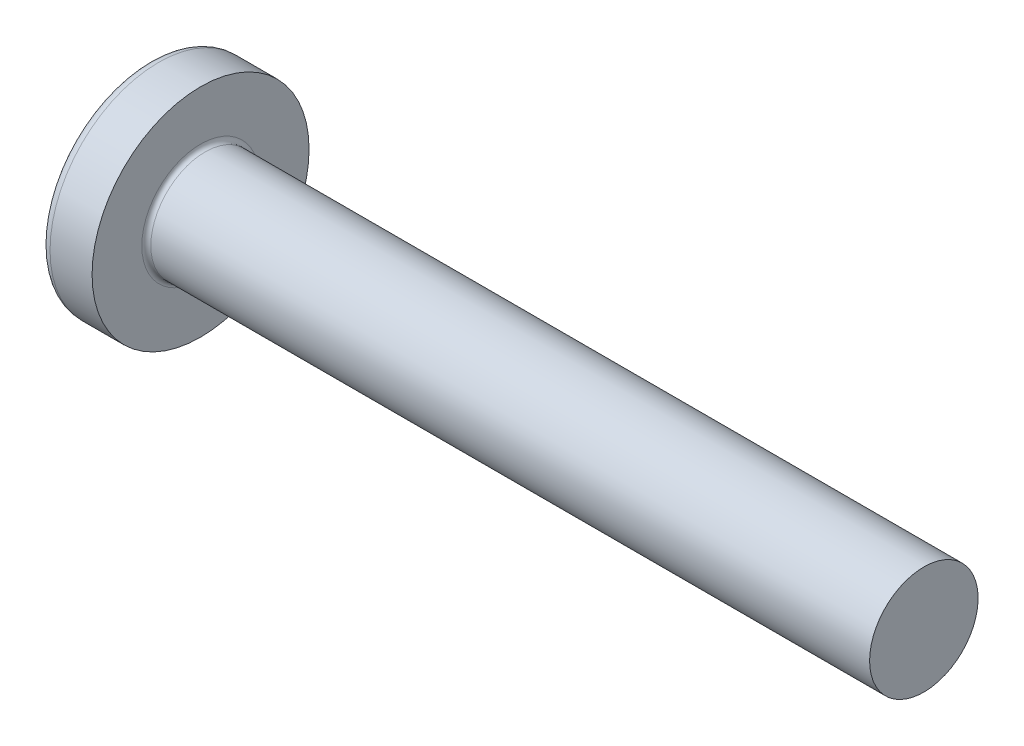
from build123d import *

# Parameters (mm, degrees)
FILLET1_R    = 0.25
RECPAT_COUNT = 2
RECPAT_ANGLE = 90


with BuildPart() as part:
    # BodySke → Base-Revolve (revolve)
    with BuildSketch(Plane.XY, mode=Mode.PRIVATE) as base_revolve_sk:
        with BuildLine():
            Line((4.6, 3), (4.6, 6))
            Line((4.6, 6), (2.274716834, 6))
            ThreePointArc((2.274716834, 6), (2.026424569, 5.939532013), (1.833738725, 5.77167019))
            ThreePointArc((1.833738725, 5.77167019), (0.469454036, 3.027985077), (0, 0))
            Line((0, 0), (44.6, 0))
            Line((44.6, 0), (44.6, 3))
            Line((44.6, 3), (4.6, 3))
        make_face()
    revolve(base_revolve_sk.sketch.rotate(Axis((2.274716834, 0, 0), (1, 0, 0)), 90), axis=Axis((2.274716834, 0, 0), (1, 0, 0)))

    # Fillet1
    fillet1_edges = [part.edges().sort_by_distance(p)[0] for p in [
        (4.6, 0, -3),
    ]]
    fillet(fillet1_edges, radius=FILLET1_R)

    # Sketch3 → Recess section 0
    with BuildSketch(Plane(origin=(0, 0, 0), x_dir=(0, 0, -1), z_dir=(1, 0, 0))):
        with BuildLine():
            Line((0.71, -3.35), (-0.71, -3.35))
            Line((-0.71, -3.35), (-0.71, 3.35))
            Line((-0.71, 3.35), (0.71, 3.35))
            Line((0.71, 3.35), (0.71, -3.35))
        make_face()
    # Sketch4 → Recess section 1
    with BuildSketch(Plane(origin=(3.46, 0, 0), x_dir=(0, 0, -1), z_dir=(1, 0, 0))):
        with BuildLine():
            Line((0.71, -1.624907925), (-0.71, -1.624907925))
            Line((-0.71, -1.624907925), (-0.71, 1.624907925))
            Line((-0.71, 1.624907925), (0.71, 1.624907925))
            Line((0.71, 1.624907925), (0.71, -1.624907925))
        make_face()
    recess = loft(mode=Mode.SUBTRACT)

    # RecPat: Recess ×2 about axis
    recpat_axis = Axis((0, 0, 0), (1, 0, 0))
    for i in range(1, RECPAT_COUNT):
        add(recess.rotate(recpat_axis, i * RECPAT_ANGLE / (RECPAT_COUNT - 1)), mode=Mode.SUBTRACT)

    # RecCorSke → RecessCore (revolve, cut)
    with BuildSketch(Plane.XY, mode=Mode.PRIVATE) as recesscore_sk:
        Polygon((0, 0), (0, 1.522446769), (3.46, 1.2805), (3.876059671, 0), align=None)
    revolve(recesscore_sk.sketch.rotate(Axis((-3.175, 0, 0), (1, 0, 0)), 12.930791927), axis=Axis((-3.175, 0, 0), (1, 0, 0)), mode=Mode.SUBTRACT)


solid = part.part
